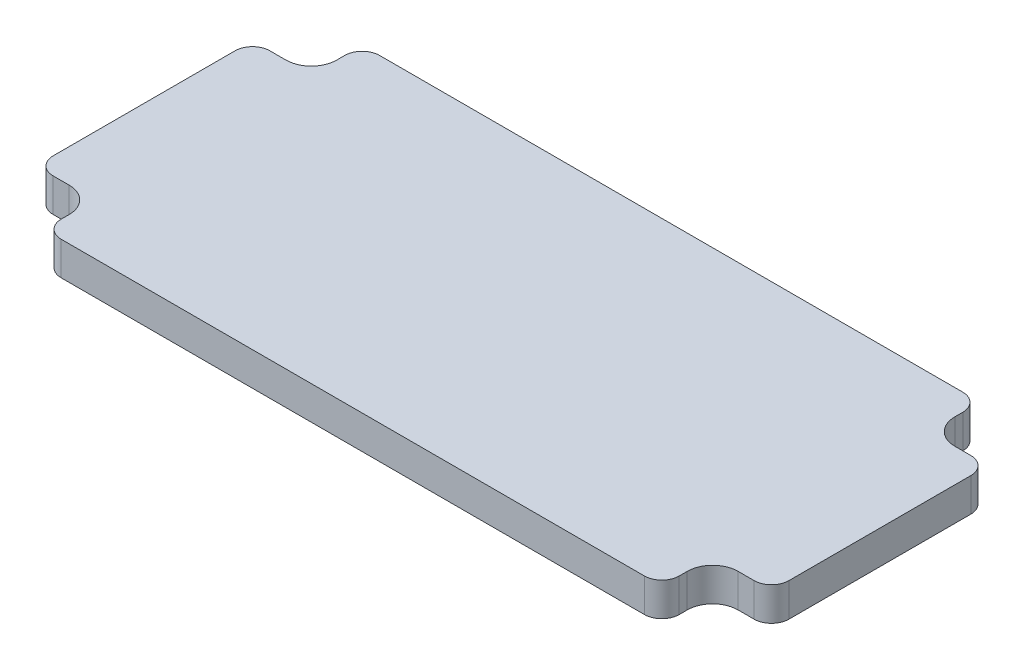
ISO-10303-21;
HEADER;
FILE_DESCRIPTION(('STEP AP214'),'2;1');
FILE_NAME('part.step','',(''),(''),'','','');
FILE_SCHEMA(('AUTOMOTIVE_DESIGN { 1 0 10303 214 1 1 1 1 }'));
ENDSEC;
DATA;
#1=APPLICATION_CONTEXT('core data for automotive mechanical design processes');
#2=APPLICATION_PROTOCOL_DEFINITION('international standard','automotive_design',2000,#1);
#3=PRODUCT_CONTEXT('',#1,'mechanical');
#4=PRODUCT('Part','Part','',(#3));
#5=PRODUCT_RELATED_PRODUCT_CATEGORY('part','',(#4));
#6=PRODUCT_DEFINITION_FORMATION('','',#4);
#7=PRODUCT_DEFINITION_CONTEXT('part definition',#1,'design');
#8=PRODUCT_DEFINITION('design','',#6,#7);
#9=PRODUCT_DEFINITION_SHAPE('','',#8);
#10=(LENGTH_UNIT() NAMED_UNIT(*) SI_UNIT(.MILLI.,.METRE.));
#11=(NAMED_UNIT(*) PLANE_ANGLE_UNIT() SI_UNIT($,.RADIAN.));
#12=(NAMED_UNIT(*) SI_UNIT($,.STERADIAN.) SOLID_ANGLE_UNIT());
#13=UNCERTAINTY_MEASURE_WITH_UNIT(LENGTH_MEASURE(1.E-05),#10,'distance_accuracy_value','');
#14=(GEOMETRIC_REPRESENTATION_CONTEXT(3) GLOBAL_UNCERTAINTY_ASSIGNED_CONTEXT((#13)) GLOBAL_UNIT_ASSIGNED_CONTEXT((#10,
#11,#12)) REPRESENTATION_CONTEXT('',''));
#15=CARTESIAN_POINT('',(0.,0.,0.));
#16=DIRECTION('',(0.,0.,1.));
#17=DIRECTION('',(1.,0.,0.));
#18=AXIS2_PLACEMENT_3D('',#15,#16,#17);
#19=CARTESIAN_POINT('',(0.,6.35,-30.226));
#20=DIRECTION('',(0.,0.,1.));
#21=DIRECTION('',(1.,0.,0.));
#22=AXIS2_PLACEMENT_3D('',#19,#20,#21);
#23=PLANE('',#22);
#24=DIRECTION('',(-1.,0.,0.));
#25=VECTOR('',#24,1.);
#26=CARTESIAN_POINT('',(0.,0.,-30.226));
#27=LINE('',#26,#25);
#28=CARTESIAN_POINT('',(55.372,0.,-30.226));
#29=VERTEX_POINT('',#28);
#30=CARTESIAN_POINT('',(-55.372,0.,-30.226));
#31=VERTEX_POINT('',#30);
#32=EDGE_CURVE('E127',#29,#31,#27,.T.);
#33=ORIENTED_EDGE('',*,*,#32,.T.);
#34=DIRECTION('',(0.,-1.,0.));
#35=VECTOR('',#34,1.);
#36=CARTESIAN_POINT('',(-55.372,6.35,-30.226));
#37=LINE('',#36,#35);
#38=CARTESIAN_POINT('',(-55.372,6.35,-30.226));
#39=VERTEX_POINT('',#38);
#40=EDGE_CURVE('E11',#39,#31,#37,.T.);
#41=ORIENTED_EDGE('',*,*,#40,.F.);
#42=DIRECTION('',(-1.,0.,0.));
#43=VECTOR('',#42,1.);
#44=CARTESIAN_POINT('',(0.,6.35,-30.226));
#45=LINE('',#44,#43);
#46=CARTESIAN_POINT('',(55.372,6.35,-30.226));
#47=VERTEX_POINT('',#46);
#48=EDGE_CURVE('E89',#47,#39,#45,.T.);
#49=ORIENTED_EDGE('',*,*,#48,.F.);
#50=DIRECTION('',(0.,-1.,0.));
#51=VECTOR('',#50,1.);
#52=CARTESIAN_POINT('',(55.372,6.35,-30.226));
#53=LINE('',#52,#51);
#54=EDGE_CURVE('E189',#47,#29,#53,.T.);
#55=ORIENTED_EDGE('',*,*,#54,.T.);
#56=EDGE_LOOP('',(#33,#41,#49,#55));
#57=FACE_BOUND('',#56,.T.);
#58=ADVANCED_FACE('F35',(#57),#23,.F.);
#59=CARTESIAN_POINT('',(-55.372,6.35,-26.924));
#60=DIRECTION('',(0.,-1.,0.));
#61=DIRECTION('',(0.,0.,-1.));
#62=AXIS2_PLACEMENT_3D('',#59,#60,#61);
#63=CYLINDRICAL_SURFACE('',#62,3.302);
#64=CARTESIAN_POINT('',(-55.372,0.,-26.924));
#65=DIRECTION('',(0.,1.,0.));
#66=DIRECTION('',(0.,0.,1.));
#67=AXIS2_PLACEMENT_3D('',#64,#65,#66);
#68=CIRCLE('',#67,3.302);
#69=CARTESIAN_POINT('',(-58.674,0.,-26.924));
#70=VERTEX_POINT('',#69);
#71=EDGE_CURVE('E129',#31,#70,#68,.T.);
#72=ORIENTED_EDGE('',*,*,#71,.T.);
#73=DIRECTION('',(0.,-1.,0.));
#74=VECTOR('',#73,1.);
#75=CARTESIAN_POINT('',(-58.674,6.35,-26.924));
#76=LINE('',#75,#74);
#77=CARTESIAN_POINT('',(-58.674,6.35,-26.924));
#78=VERTEX_POINT('',#77);
#79=EDGE_CURVE('E43',#78,#70,#76,.T.);
#80=ORIENTED_EDGE('',*,*,#79,.F.);
#81=CARTESIAN_POINT('',(-55.372,6.35,-26.924));
#82=DIRECTION('',(0.,1.,0.));
#83=DIRECTION('',(0.,0.,1.));
#84=AXIS2_PLACEMENT_3D('',#81,#82,#83);
#85=CIRCLE('',#84,3.302);
#86=EDGE_CURVE('E183',#39,#78,#85,.T.);
#87=ORIENTED_EDGE('',*,*,#86,.F.);
#88=ORIENTED_EDGE('',*,*,#40,.T.);
#89=EDGE_LOOP('',(#72,#80,#87,#88));
#90=FACE_BOUND('',#89,.T.);
#91=ADVANCED_FACE('F184',(#90),#63,.T.);
#92=CARTESIAN_POINT('',(-58.674,6.35,-25.4));
#93=DIRECTION('',(1.,0.,0.));
#94=DIRECTION('',(0.,0.,-1.));
#95=AXIS2_PLACEMENT_3D('',#92,#93,#94);
#96=PLANE('',#95);
#97=DIRECTION('',(0.,0.,1.));
#98=VECTOR('',#97,1.);
#99=CARTESIAN_POINT('',(-58.674,0.,-25.4));
#100=LINE('',#99,#98);
#101=CARTESIAN_POINT('',(-58.674,0.,-25.4));
#102=VERTEX_POINT('',#101);
#103=EDGE_CURVE('E132',#70,#102,#100,.T.);
#104=ORIENTED_EDGE('',*,*,#103,.T.);
#105=DIRECTION('',(0.,-1.,0.));
#106=VECTOR('',#105,1.);
#107=CARTESIAN_POINT('',(-58.674,6.35,-25.4));
#108=LINE('',#107,#106);
#109=CARTESIAN_POINT('',(-58.674,6.35,-25.4));
#110=VERTEX_POINT('',#109);
#111=EDGE_CURVE('E116',#110,#102,#108,.T.);
#112=ORIENTED_EDGE('',*,*,#111,.F.);
#113=DIRECTION('',(0.,0.,1.));
#114=VECTOR('',#113,1.);
#115=CARTESIAN_POINT('',(-58.674,6.35,-25.4));
#116=LINE('',#115,#114);
#117=EDGE_CURVE('E107',#78,#110,#116,.T.);
#118=ORIENTED_EDGE('',*,*,#117,.F.);
#119=ORIENTED_EDGE('',*,*,#79,.T.);
#120=EDGE_LOOP('',(#104,#112,#118,#119));
#121=FACE_BOUND('',#120,.T.);
#122=ADVANCED_FACE('F146',(#121),#96,.F.);
#123=CARTESIAN_POINT('',(-63.5,6.35,-25.4));
#124=DIRECTION('',(0.,-1.,0.));
#125=DIRECTION('',(0.,0.,-1.));
#126=AXIS2_PLACEMENT_3D('',#123,#124,#125);
#127=CYLINDRICAL_SURFACE('',#126,4.826);
#128=CARTESIAN_POINT('',(-63.5,0.,-25.4));
#129=DIRECTION('',(0.,-1.,0.));
#130=DIRECTION('',(0.,0.,1.));
#131=AXIS2_PLACEMENT_3D('',#128,#129,#130);
#132=CIRCLE('',#131,4.826);
#133=CARTESIAN_POINT('',(-63.5,0.,-20.574));
#134=VERTEX_POINT('',#133);
#135=EDGE_CURVE('E115',#102,#134,#132,.T.);
#136=ORIENTED_EDGE('',*,*,#135,.T.);
#137=DIRECTION('',(0.,-1.,0.));
#138=VECTOR('',#137,1.);
#139=CARTESIAN_POINT('',(-63.5,6.35,-20.574));
#140=LINE('',#139,#138);
#141=CARTESIAN_POINT('',(-63.5,6.35,-20.574));
#142=VERTEX_POINT('',#141);
#143=EDGE_CURVE('E112',#142,#134,#140,.T.);
#144=ORIENTED_EDGE('',*,*,#143,.F.);
#145=CARTESIAN_POINT('',(-63.5,6.35,-25.4));
#146=DIRECTION('',(0.,-1.,0.));
#147=DIRECTION('',(0.,0.,1.));
#148=AXIS2_PLACEMENT_3D('',#145,#146,#147);
#149=CIRCLE('',#148,4.826);
#150=EDGE_CURVE('E100',#110,#142,#149,.T.);
#151=ORIENTED_EDGE('',*,*,#150,.F.);
#152=ORIENTED_EDGE('',*,*,#111,.T.);
#153=EDGE_LOOP('',(#136,#144,#151,#152));
#154=FACE_BOUND('',#153,.T.);
#155=ADVANCED_FACE('F113',(#154),#127,.F.);
#156=CARTESIAN_POINT('',(-63.5,6.35,-20.574));
#157=DIRECTION('',(0.,0.,1.));
#158=DIRECTION('',(1.,0.,0.));
#159=AXIS2_PLACEMENT_3D('',#156,#157,#158);
#160=PLANE('',#159);
#161=DIRECTION('',(-1.,0.,0.));
#162=VECTOR('',#161,1.);
#163=CARTESIAN_POINT('',(-63.5,0.,-20.574));
#164=LINE('',#163,#162);
#165=CARTESIAN_POINT('',(-66.548,0.,-20.574));
#166=VERTEX_POINT('',#165);
#167=EDGE_CURVE('E75',#134,#166,#164,.T.);
#168=ORIENTED_EDGE('',*,*,#167,.T.);
#169=DIRECTION('',(0.,-1.,0.));
#170=VECTOR('',#169,1.);
#171=CARTESIAN_POINT('',(-66.548,6.35,-20.574));
#172=LINE('',#171,#170);
#173=CARTESIAN_POINT('',(-66.548,6.35,-20.574));
#174=VERTEX_POINT('',#173);
#175=EDGE_CURVE('E117',#174,#166,#172,.T.);
#176=ORIENTED_EDGE('',*,*,#175,.F.);
#177=DIRECTION('',(-1.,0.,0.));
#178=VECTOR('',#177,1.);
#179=CARTESIAN_POINT('',(-63.5,6.35,-20.574));
#180=LINE('',#179,#178);
#181=EDGE_CURVE('E105',#142,#174,#180,.T.);
#182=ORIENTED_EDGE('',*,*,#181,.F.);
#183=ORIENTED_EDGE('',*,*,#143,.T.);
#184=EDGE_LOOP('',(#168,#176,#182,#183));
#185=FACE_BOUND('',#184,.T.);
#186=ADVANCED_FACE('F119',(#185),#160,.F.);
#187=CARTESIAN_POINT('',(-66.548,6.35,-17.272));
#188=DIRECTION('',(0.,-1.,0.));
#189=DIRECTION('',(0.,0.,-1.));
#190=AXIS2_PLACEMENT_3D('',#187,#188,#189);
#191=CYLINDRICAL_SURFACE('',#190,3.302);
#192=CARTESIAN_POINT('',(-66.548,0.,-17.272));
#193=DIRECTION('',(0.,1.,0.));
#194=DIRECTION('',(0.,0.,-1.));
#195=AXIS2_PLACEMENT_3D('',#192,#193,#194);
#196=CIRCLE('',#195,3.302);
#197=CARTESIAN_POINT('',(-69.85,0.,-17.272));
#198=VERTEX_POINT('',#197);
#199=EDGE_CURVE('E81',#166,#198,#196,.T.);
#200=ORIENTED_EDGE('',*,*,#199,.T.);
#201=DIRECTION('',(0.,-1.,0.));
#202=VECTOR('',#201,1.);
#203=CARTESIAN_POINT('',(-69.85,6.35,-17.272));
#204=LINE('',#203,#202);
#205=CARTESIAN_POINT('',(-69.85,6.35,-17.272));
#206=VERTEX_POINT('',#205);
#207=EDGE_CURVE('E126',#206,#198,#204,.T.);
#208=ORIENTED_EDGE('',*,*,#207,.F.);
#209=CARTESIAN_POINT('',(-66.548,6.35,-17.272));
#210=DIRECTION('',(0.,1.,0.));
#211=DIRECTION('',(0.,0.,-1.));
#212=AXIS2_PLACEMENT_3D('',#209,#210,#211);
#213=CIRCLE('',#212,3.302);
#214=EDGE_CURVE('E51',#174,#206,#213,.T.);
#215=ORIENTED_EDGE('',*,*,#214,.F.);
#216=ORIENTED_EDGE('',*,*,#175,.T.);
#217=EDGE_LOOP('',(#200,#208,#215,#216));
#218=FACE_BOUND('',#217,.T.);
#219=ADVANCED_FACE('F484',(#218),#191,.T.);
#220=CARTESIAN_POINT('',(-69.85,6.35,0.));
#221=DIRECTION('',(1.,0.,0.));
#222=DIRECTION('',(0.,0.,-1.));
#223=AXIS2_PLACEMENT_3D('',#220,#221,#222);
#224=PLANE('',#223);
#225=DIRECTION('',(0.,0.,1.));
#226=VECTOR('',#225,1.);
#227=CARTESIAN_POINT('',(-69.85,0.,0.));
#228=LINE('',#227,#226);
#229=CARTESIAN_POINT('',(-69.85,0.,17.272));
#230=VERTEX_POINT('',#229);
#231=EDGE_CURVE('E137',#198,#230,#228,.T.);
#232=ORIENTED_EDGE('',*,*,#231,.T.);
#233=DIRECTION('',(0.,-1.,0.));
#234=VECTOR('',#233,1.);
#235=CARTESIAN_POINT('',(-69.85,6.35,17.272));
#236=LINE('',#235,#234);
#237=CARTESIAN_POINT('',(-69.85,6.35,17.272));
#238=VERTEX_POINT('',#237);
#239=EDGE_CURVE('E130',#238,#230,#236,.T.);
#240=ORIENTED_EDGE('',*,*,#239,.F.);
#241=DIRECTION('',(0.,0.,1.));
#242=VECTOR('',#241,1.);
#243=CARTESIAN_POINT('',(-69.85,6.35,0.));
#244=LINE('',#243,#242);
#245=EDGE_CURVE('E121',#206,#238,#244,.T.);
#246=ORIENTED_EDGE('',*,*,#245,.F.);
#247=ORIENTED_EDGE('',*,*,#207,.T.);
#248=EDGE_LOOP('',(#232,#240,#246,#247));
#249=FACE_BOUND('',#248,.T.);
#250=ADVANCED_FACE('F163',(#249),#224,.F.);
#251=CARTESIAN_POINT('',(-55.372,6.35,-26.924));
#252=DIRECTION('',(0.,1.,0.));
#253=DIRECTION('',(0.,0.,1.));
#254=AXIS2_PLACEMENT_3D('',#251,#252,#253);
#255=PLANE('',#254);
#256=DIRECTION('',(-1.,0.,0.));
#257=VECTOR('',#256,1.);
#258=CARTESIAN_POINT('',(0.,6.35,30.226));
#259=LINE('',#258,#257);
#260=CARTESIAN_POINT('',(55.372,6.35,30.226));
#261=VERTEX_POINT('',#260);
#262=CARTESIAN_POINT('',(-55.372,6.35,30.226));
#263=VERTEX_POINT('',#262);
#264=EDGE_CURVE('E243',#261,#263,#259,.T.);
#265=ORIENTED_EDGE('',*,*,#264,.F.);
#266=CARTESIAN_POINT('',(55.372,6.35,26.924));
#267=DIRECTION('',(0.,1.,0.));
#268=DIRECTION('',(0.,0.,-1.));
#269=AXIS2_PLACEMENT_3D('',#266,#267,#268);
#270=CIRCLE('',#269,3.302);
#271=CARTESIAN_POINT('',(58.674,6.35,26.924));
#272=VERTEX_POINT('',#271);
#273=EDGE_CURVE('E357',#261,#272,#270,.T.);
#274=ORIENTED_EDGE('',*,*,#273,.T.);
#275=DIRECTION('',(0.,0.,-1.));
#276=VECTOR('',#275,1.);
#277=CARTESIAN_POINT('',(58.674,6.35,25.4));
#278=LINE('',#277,#276);
#279=CARTESIAN_POINT('',(58.674,6.35,25.4));
#280=VERTEX_POINT('',#279);
#281=EDGE_CURVE('E376',#272,#280,#278,.T.);
#282=ORIENTED_EDGE('',*,*,#281,.T.);
#283=CARTESIAN_POINT('',(63.5,6.35,25.4));
#284=DIRECTION('',(0.,-1.,0.));
#285=DIRECTION('',(0.,0.,-1.));
#286=AXIS2_PLACEMENT_3D('',#283,#284,#285);
#287=CIRCLE('',#286,4.826);
#288=CARTESIAN_POINT('',(63.5,6.35,20.574));
#289=VERTEX_POINT('',#288);
#290=EDGE_CURVE('E373',#280,#289,#287,.T.);
#291=ORIENTED_EDGE('',*,*,#290,.T.);
#292=DIRECTION('',(1.,0.,0.));
#293=VECTOR('',#292,1.);
#294=CARTESIAN_POINT('',(63.5,6.35,20.574));
#295=LINE('',#294,#293);
#296=CARTESIAN_POINT('',(66.548,6.35,20.574));
#297=VERTEX_POINT('',#296);
#298=EDGE_CURVE('E370',#289,#297,#295,.T.);
#299=ORIENTED_EDGE('',*,*,#298,.T.);
#300=CARTESIAN_POINT('',(66.548,6.35,17.272));
#301=DIRECTION('',(0.,1.,0.));
#302=DIRECTION('',(0.,0.,1.));
#303=AXIS2_PLACEMENT_3D('',#300,#301,#302);
#304=CIRCLE('',#303,3.302);
#305=CARTESIAN_POINT('',(69.85,6.35,17.272));
#306=VERTEX_POINT('',#305);
#307=EDGE_CURVE('E353',#297,#306,#304,.T.);
#308=ORIENTED_EDGE('',*,*,#307,.T.);
#309=DIRECTION('',(0.,0.,1.));
#310=VECTOR('',#309,1.);
#311=CARTESIAN_POINT('',(69.85,6.35,0.));
#312=LINE('',#311,#310);
#313=CARTESIAN_POINT('',(69.85,6.35,-17.272));
#314=VERTEX_POINT('',#313);
#315=EDGE_CURVE('E305',#314,#306,#312,.T.);
#316=ORIENTED_EDGE('',*,*,#315,.F.);
#317=CARTESIAN_POINT('',(66.548,6.35,-17.272));
#318=DIRECTION('',(0.,-1.,0.));
#319=DIRECTION('',(0.,0.,-1.));
#320=AXIS2_PLACEMENT_3D('',#317,#318,#319);
#321=CIRCLE('',#320,3.302);
#322=CARTESIAN_POINT('',(66.548,6.35,-20.574));
#323=VERTEX_POINT('',#322);
#324=EDGE_CURVE('E332',#323,#314,#321,.T.);
#325=ORIENTED_EDGE('',*,*,#324,.F.);
#326=DIRECTION('',(1.,0.,0.));
#327=VECTOR('',#326,1.);
#328=CARTESIAN_POINT('',(63.5,6.35,-20.574));
#329=LINE('',#328,#327);
#330=CARTESIAN_POINT('',(63.5,6.35,-20.574));
#331=VERTEX_POINT('',#330);
#332=EDGE_CURVE('E329',#331,#323,#329,.T.);
#333=ORIENTED_EDGE('',*,*,#332,.F.);
#334=CARTESIAN_POINT('',(63.5,6.35,-25.4));
#335=DIRECTION('',(0.,1.,0.));
#336=DIRECTION('',(0.,0.,1.));
#337=AXIS2_PLACEMENT_3D('',#334,#335,#336);
#338=CIRCLE('',#337,4.826);
#339=CARTESIAN_POINT('',(58.674,6.35,-25.4));
#340=VERTEX_POINT('',#339);
#341=EDGE_CURVE('E326',#340,#331,#338,.T.);
#342=ORIENTED_EDGE('',*,*,#341,.F.);
#343=DIRECTION('',(0.,0.,1.));
#344=VECTOR('',#343,1.);
#345=CARTESIAN_POINT('',(58.674,6.35,-25.4));
#346=LINE('',#345,#344);
#347=CARTESIAN_POINT('',(58.674,6.35,-26.924));
#348=VERTEX_POINT('',#347);
#349=EDGE_CURVE('E323',#348,#340,#346,.T.);
#350=ORIENTED_EDGE('',*,*,#349,.F.);
#351=CARTESIAN_POINT('',(55.372,6.35,-26.924));
#352=DIRECTION('',(0.,-1.,0.));
#353=DIRECTION('',(0.,0.,1.));
#354=AXIS2_PLACEMENT_3D('',#351,#352,#353);
#355=CIRCLE('',#354,3.302);
#356=EDGE_CURVE('E303',#47,#348,#355,.T.);
#357=ORIENTED_EDGE('',*,*,#356,.F.);
#358=ORIENTED_EDGE('',*,*,#48,.T.);
#359=ORIENTED_EDGE('',*,*,#86,.T.);
#360=ORIENTED_EDGE('',*,*,#117,.T.);
#361=ORIENTED_EDGE('',*,*,#150,.T.);
#362=ORIENTED_EDGE('',*,*,#181,.T.);
#363=ORIENTED_EDGE('',*,*,#214,.T.);
#364=ORIENTED_EDGE('',*,*,#245,.T.);
#365=CARTESIAN_POINT('',(-66.548,6.35,17.272));
#366=DIRECTION('',(0.,-1.,0.));
#367=DIRECTION('',(0.,0.,1.));
#368=AXIS2_PLACEMENT_3D('',#365,#366,#367);
#369=CIRCLE('',#368,3.302);
#370=CARTESIAN_POINT('',(-66.548,6.35,20.574));
#371=VERTEX_POINT('',#370);
#372=EDGE_CURVE('E174',#371,#238,#369,.T.);
#373=ORIENTED_EDGE('',*,*,#372,.F.);
#374=DIRECTION('',(-1.,0.,0.));
#375=VECTOR('',#374,1.);
#376=CARTESIAN_POINT('',(-63.5,6.35,20.574));
#377=LINE('',#376,#375);
#378=CARTESIAN_POINT('',(-63.5,6.35,20.574));
#379=VERTEX_POINT('',#378);
#380=EDGE_CURVE('E256',#379,#371,#377,.T.);
#381=ORIENTED_EDGE('',*,*,#380,.F.);
#382=CARTESIAN_POINT('',(-63.5,6.35,25.4));
#383=DIRECTION('',(0.,1.,0.));
#384=DIRECTION('',(0.,0.,-1.));
#385=AXIS2_PLACEMENT_3D('',#382,#383,#384);
#386=CIRCLE('',#385,4.826);
#387=CARTESIAN_POINT('',(-58.674,6.35,25.4));
#388=VERTEX_POINT('',#387);
#389=EDGE_CURVE('E270',#388,#379,#386,.T.);
#390=ORIENTED_EDGE('',*,*,#389,.F.);
#391=DIRECTION('',(0.,0.,-1.));
#392=VECTOR('',#391,1.);
#393=CARTESIAN_POINT('',(-58.674,6.35,25.4));
#394=LINE('',#393,#392);
#395=CARTESIAN_POINT('',(-58.674,6.35,26.924));
#396=VERTEX_POINT('',#395);
#397=EDGE_CURVE('E284',#396,#388,#394,.T.);
#398=ORIENTED_EDGE('',*,*,#397,.F.);
#399=CARTESIAN_POINT('',(-55.372,6.35,26.924));
#400=DIRECTION('',(0.,-1.,0.));
#401=DIRECTION('',(0.,0.,-1.));
#402=AXIS2_PLACEMENT_3D('',#399,#400,#401);
#403=CIRCLE('',#402,3.302);
#404=EDGE_CURVE('E282',#263,#396,#403,.T.);
#405=ORIENTED_EDGE('',*,*,#404,.F.);
#406=EDGE_LOOP('',(#265,#274,#282,#291,#299,#308,#316,#325,#333,#342,#350,#357,#358,#359,#360,
#361,#362,#363,#364,#373,#381,#390,#398,#405));
#407=FACE_BOUND('',#406,.T.);
#408=ADVANCED_FACE('F103',(#407),#255,.T.);
#409=CARTESIAN_POINT('',(-55.372,0.,-26.924));
#410=DIRECTION('',(0.,1.,0.));
#411=DIRECTION('',(0.,0.,1.));
#412=AXIS2_PLACEMENT_3D('',#409,#410,#411);
#413=PLANE('',#412);
#414=CARTESIAN_POINT('',(55.372,0.,26.924));
#415=DIRECTION('',(0.,1.,0.));
#416=DIRECTION('',(0.,0.,-1.));
#417=AXIS2_PLACEMENT_3D('',#414,#415,#416);
#418=CIRCLE('',#417,3.302);
#419=CARTESIAN_POINT('',(55.372,0.,30.226));
#420=VERTEX_POINT('',#419);
#421=CARTESIAN_POINT('',(58.674,0.,26.924));
#422=VERTEX_POINT('',#421);
#423=EDGE_CURVE('E254',#420,#422,#418,.T.);
#424=ORIENTED_EDGE('',*,*,#423,.F.);
#425=DIRECTION('',(-1.,0.,0.));
#426=VECTOR('',#425,1.);
#427=CARTESIAN_POINT('',(0.,0.,30.226));
#428=LINE('',#427,#426);
#429=CARTESIAN_POINT('',(-55.372,0.,30.226));
#430=VERTEX_POINT('',#429);
#431=EDGE_CURVE('E241',#420,#430,#428,.T.);
#432=ORIENTED_EDGE('',*,*,#431,.T.);
#433=CARTESIAN_POINT('',(-55.372,0.,26.924));
#434=DIRECTION('',(0.,-1.,0.));
#435=DIRECTION('',(0.,0.,-1.));
#436=AXIS2_PLACEMENT_3D('',#433,#434,#435);
#437=CIRCLE('',#436,3.302);
#438=CARTESIAN_POINT('',(-58.674,0.,26.924));
#439=VERTEX_POINT('',#438);
#440=EDGE_CURVE('E247',#430,#439,#437,.T.);
#441=ORIENTED_EDGE('',*,*,#440,.T.);
#442=DIRECTION('',(0.,0.,-1.));
#443=VECTOR('',#442,1.);
#444=CARTESIAN_POINT('',(-58.674,0.,25.4));
#445=LINE('',#444,#443);
#446=CARTESIAN_POINT('',(-58.674,0.,25.4));
#447=VERTEX_POINT('',#446);
#448=EDGE_CURVE('E250',#439,#447,#445,.T.);
#449=ORIENTED_EDGE('',*,*,#448,.T.);
#450=CARTESIAN_POINT('',(-63.5,0.,25.4));
#451=DIRECTION('',(0.,1.,0.));
#452=DIRECTION('',(0.,0.,-1.));
#453=AXIS2_PLACEMENT_3D('',#450,#451,#452);
#454=CIRCLE('',#453,4.826);
#455=CARTESIAN_POINT('',(-63.5,0.,20.574));
#456=VERTEX_POINT('',#455);
#457=EDGE_CURVE('E268',#447,#456,#454,.T.);
#458=ORIENTED_EDGE('',*,*,#457,.T.);
#459=DIRECTION('',(-1.,0.,0.));
#460=VECTOR('',#459,1.);
#461=CARTESIAN_POINT('',(-63.5,0.,20.574));
#462=LINE('',#461,#460);
#463=CARTESIAN_POINT('',(-66.548,0.,20.574));
#464=VERTEX_POINT('',#463);
#465=EDGE_CURVE('E274',#456,#464,#462,.T.);
#466=ORIENTED_EDGE('',*,*,#465,.T.);
#467=CARTESIAN_POINT('',(-66.548,0.,17.272));
#468=DIRECTION('',(0.,-1.,0.));
#469=DIRECTION('',(0.,0.,1.));
#470=AXIS2_PLACEMENT_3D('',#467,#468,#469);
#471=CIRCLE('',#470,3.302);
#472=EDGE_CURVE('E159',#464,#230,#471,.T.);
#473=ORIENTED_EDGE('',*,*,#472,.T.);
#474=ORIENTED_EDGE('',*,*,#231,.F.);
#475=ORIENTED_EDGE('',*,*,#199,.F.);
#476=ORIENTED_EDGE('',*,*,#167,.F.);
#477=ORIENTED_EDGE('',*,*,#135,.F.);
#478=ORIENTED_EDGE('',*,*,#103,.F.);
#479=ORIENTED_EDGE('',*,*,#71,.F.);
#480=ORIENTED_EDGE('',*,*,#32,.F.);
#481=CARTESIAN_POINT('',(55.372,0.,-26.924));
#482=DIRECTION('',(0.,-1.,0.));
#483=DIRECTION('',(0.,0.,1.));
#484=AXIS2_PLACEMENT_3D('',#481,#482,#483);
#485=CIRCLE('',#484,3.302);
#486=CARTESIAN_POINT('',(58.674,0.,-26.924));
#487=VERTEX_POINT('',#486);
#488=EDGE_CURVE('E194',#29,#487,#485,.T.);
#489=ORIENTED_EDGE('',*,*,#488,.T.);
#490=DIRECTION('',(0.,0.,1.));
#491=VECTOR('',#490,1.);
#492=CARTESIAN_POINT('',(58.674,0.,-25.4));
#493=LINE('',#492,#491);
#494=CARTESIAN_POINT('',(58.674,0.,-25.4));
#495=VERTEX_POINT('',#494);
#496=EDGE_CURVE('E306',#487,#495,#493,.T.);
#497=ORIENTED_EDGE('',*,*,#496,.T.);
#498=CARTESIAN_POINT('',(63.5,0.,-25.4));
#499=DIRECTION('',(0.,1.,0.));
#500=DIRECTION('',(0.,0.,1.));
#501=AXIS2_PLACEMENT_3D('',#498,#499,#500);
#502=CIRCLE('',#501,4.826);
#503=CARTESIAN_POINT('',(63.5,0.,-20.574));
#504=VERTEX_POINT('',#503);
#505=EDGE_CURVE('E308',#495,#504,#502,.T.);
#506=ORIENTED_EDGE('',*,*,#505,.T.);
#507=DIRECTION('',(1.,0.,0.));
#508=VECTOR('',#507,1.);
#509=CARTESIAN_POINT('',(63.5,0.,-20.574));
#510=LINE('',#509,#508);
#511=CARTESIAN_POINT('',(66.548,0.,-20.574));
#512=VERTEX_POINT('',#511);
#513=EDGE_CURVE('E311',#504,#512,#510,.T.);
#514=ORIENTED_EDGE('',*,*,#513,.T.);
#515=CARTESIAN_POINT('',(66.548,0.,-17.272));
#516=DIRECTION('',(0.,-1.,0.));
#517=DIRECTION('',(0.,0.,-1.));
#518=AXIS2_PLACEMENT_3D('',#515,#516,#517);
#519=CIRCLE('',#518,3.302);
#520=CARTESIAN_POINT('',(69.85,0.,-17.272));
#521=VERTEX_POINT('',#520);
#522=EDGE_CURVE('E314',#512,#521,#519,.T.);
#523=ORIENTED_EDGE('',*,*,#522,.T.);
#524=DIRECTION('',(0.,0.,1.));
#525=VECTOR('',#524,1.);
#526=CARTESIAN_POINT('',(69.85,0.,0.));
#527=LINE('',#526,#525);
#528=CARTESIAN_POINT('',(69.85,0.,17.272));
#529=VERTEX_POINT('',#528);
#530=EDGE_CURVE('E317',#521,#529,#527,.T.);
#531=ORIENTED_EDGE('',*,*,#530,.T.);
#532=CARTESIAN_POINT('',(66.548,0.,17.272));
#533=DIRECTION('',(0.,1.,0.));
#534=DIRECTION('',(0.,0.,1.));
#535=AXIS2_PLACEMENT_3D('',#532,#533,#534);
#536=CIRCLE('',#535,3.302);
#537=CARTESIAN_POINT('',(66.548,0.,20.574));
#538=VERTEX_POINT('',#537);
#539=EDGE_CURVE('E354',#538,#529,#536,.T.);
#540=ORIENTED_EDGE('',*,*,#539,.F.);
#541=DIRECTION('',(1.,0.,0.));
#542=VECTOR('',#541,1.);
#543=CARTESIAN_POINT('',(63.5,0.,20.574));
#544=LINE('',#543,#542);
#545=CARTESIAN_POINT('',(63.5,0.,20.574));
#546=VERTEX_POINT('',#545);
#547=EDGE_CURVE('E358',#546,#538,#544,.T.);
#548=ORIENTED_EDGE('',*,*,#547,.F.);
#549=CARTESIAN_POINT('',(63.5,0.,25.4));
#550=DIRECTION('',(0.,-1.,0.));
#551=DIRECTION('',(0.,0.,-1.));
#552=AXIS2_PLACEMENT_3D('',#549,#550,#551);
#553=CIRCLE('',#552,4.826);
#554=CARTESIAN_POINT('',(58.674,0.,25.4));
#555=VERTEX_POINT('',#554);
#556=EDGE_CURVE('E361',#555,#546,#553,.T.);
#557=ORIENTED_EDGE('',*,*,#556,.F.);
#558=DIRECTION('',(0.,0.,-1.));
#559=VECTOR('',#558,1.);
#560=CARTESIAN_POINT('',(58.674,0.,25.4));
#561=LINE('',#560,#559);
#562=EDGE_CURVE('E364',#422,#555,#561,.T.);
#563=ORIENTED_EDGE('',*,*,#562,.F.);
#564=EDGE_LOOP('',(#424,#432,#441,#449,#458,#466,#473,#474,#475,#476,#477,#478,#479,#480,#489,
#497,#506,#514,#523,#531,#540,#548,#557,#563));
#565=FACE_BOUND('',#564,.T.);
#566=ADVANCED_FACE('F152',(#565),#413,.F.);
#567=CARTESIAN_POINT('',(-66.548,6.35,17.272));
#568=DIRECTION('',(0.,-1.,0.));
#569=DIRECTION('',(0.,0.,-1.));
#570=AXIS2_PLACEMENT_3D('',#567,#568,#569);
#571=CYLINDRICAL_SURFACE('',#570,3.302);
#572=ORIENTED_EDGE('',*,*,#472,.F.);
#573=DIRECTION('',(0.,-1.,0.));
#574=VECTOR('',#573,1.);
#575=CARTESIAN_POINT('',(-66.548,6.35,20.574));
#576=LINE('',#575,#574);
#577=EDGE_CURVE('E175',#371,#464,#576,.T.);
#578=ORIENTED_EDGE('',*,*,#577,.F.);
#579=ORIENTED_EDGE('',*,*,#372,.T.);
#580=ORIENTED_EDGE('',*,*,#239,.T.);
#581=EDGE_LOOP('',(#572,#578,#579,#580));
#582=FACE_BOUND('',#581,.T.);
#583=ADVANCED_FACE('F171',(#582),#571,.T.);
#584=CARTESIAN_POINT('',(-63.5,6.35,20.574));
#585=DIRECTION('',(0.,0.,1.));
#586=DIRECTION('',(1.,0.,0.));
#587=AXIS2_PLACEMENT_3D('',#584,#585,#586);
#588=PLANE('',#587);
#589=ORIENTED_EDGE('',*,*,#465,.F.);
#590=DIRECTION('',(0.,-1.,0.));
#591=VECTOR('',#590,1.);
#592=CARTESIAN_POINT('',(-63.5,6.35,20.574));
#593=LINE('',#592,#591);
#594=EDGE_CURVE('E178',#379,#456,#593,.T.);
#595=ORIENTED_EDGE('',*,*,#594,.F.);
#596=ORIENTED_EDGE('',*,*,#380,.T.);
#597=ORIENTED_EDGE('',*,*,#577,.T.);
#598=EDGE_LOOP('',(#589,#595,#596,#597));
#599=FACE_BOUND('',#598,.T.);
#600=ADVANCED_FACE('F275',(#599),#588,.T.);
#601=CARTESIAN_POINT('',(-63.5,6.35,25.4));
#602=DIRECTION('',(0.,-1.,0.));
#603=DIRECTION('',(0.,0.,-1.));
#604=AXIS2_PLACEMENT_3D('',#601,#602,#603);
#605=CYLINDRICAL_SURFACE('',#604,4.826);
#606=ORIENTED_EDGE('',*,*,#457,.F.);
#607=DIRECTION('',(0.,-1.,0.));
#608=VECTOR('',#607,1.);
#609=CARTESIAN_POINT('',(-58.674,6.35,25.4));
#610=LINE('',#609,#608);
#611=EDGE_CURVE('E261',#388,#447,#610,.T.);
#612=ORIENTED_EDGE('',*,*,#611,.F.);
#613=ORIENTED_EDGE('',*,*,#389,.T.);
#614=ORIENTED_EDGE('',*,*,#594,.T.);
#615=EDGE_LOOP('',(#606,#612,#613,#614));
#616=FACE_BOUND('',#615,.T.);
#617=ADVANCED_FACE('F266',(#616),#605,.F.);
#618=CARTESIAN_POINT('',(-58.674,6.35,25.4));
#619=DIRECTION('',(-1.,0.,0.));
#620=DIRECTION('',(0.,0.,1.));
#621=AXIS2_PLACEMENT_3D('',#618,#619,#620);
#622=PLANE('',#621);
#623=ORIENTED_EDGE('',*,*,#448,.F.);
#624=DIRECTION('',(0.,-1.,0.));
#625=VECTOR('',#624,1.);
#626=CARTESIAN_POINT('',(-58.674,6.35,26.924));
#627=LINE('',#626,#625);
#628=EDGE_CURVE('E230',#396,#439,#627,.T.);
#629=ORIENTED_EDGE('',*,*,#628,.F.);
#630=ORIENTED_EDGE('',*,*,#397,.T.);
#631=ORIENTED_EDGE('',*,*,#611,.T.);
#632=EDGE_LOOP('',(#623,#629,#630,#631));
#633=FACE_BOUND('',#632,.T.);
#634=ADVANCED_FACE('F499',(#633),#622,.T.);
#635=CARTESIAN_POINT('',(-55.372,6.35,26.924));
#636=DIRECTION('',(0.,-1.,0.));
#637=DIRECTION('',(0.,0.,-1.));
#638=AXIS2_PLACEMENT_3D('',#635,#636,#637);
#639=CYLINDRICAL_SURFACE('',#638,3.302);
#640=ORIENTED_EDGE('',*,*,#440,.F.);
#641=DIRECTION('',(0.,-1.,0.));
#642=VECTOR('',#641,1.);
#643=CARTESIAN_POINT('',(-55.372,6.35,30.226));
#644=LINE('',#643,#642);
#645=EDGE_CURVE('E236',#263,#430,#644,.T.);
#646=ORIENTED_EDGE('',*,*,#645,.F.);
#647=ORIENTED_EDGE('',*,*,#404,.T.);
#648=ORIENTED_EDGE('',*,*,#628,.T.);
#649=EDGE_LOOP('',(#640,#646,#647,#648));
#650=FACE_BOUND('',#649,.T.);
#651=ADVANCED_FACE('F248',(#650),#639,.T.);
#652=CARTESIAN_POINT('',(0.,6.35,30.226));
#653=DIRECTION('',(0.,0.,1.));
#654=DIRECTION('',(1.,0.,0.));
#655=AXIS2_PLACEMENT_3D('',#652,#653,#654);
#656=PLANE('',#655);
#657=ORIENTED_EDGE('',*,*,#431,.F.);
#658=DIRECTION('',(0.,-1.,0.));
#659=VECTOR('',#658,1.);
#660=CARTESIAN_POINT('',(55.372,6.35,30.226));
#661=LINE('',#660,#659);
#662=EDGE_CURVE('E320',#261,#420,#661,.T.);
#663=ORIENTED_EDGE('',*,*,#662,.F.);
#664=ORIENTED_EDGE('',*,*,#264,.T.);
#665=ORIENTED_EDGE('',*,*,#645,.T.);
#666=EDGE_LOOP('',(#657,#663,#664,#665));
#667=FACE_BOUND('',#666,.T.);
#668=ADVANCED_FACE('F237',(#667),#656,.T.);
#669=CARTESIAN_POINT('',(69.85,6.35,0.));
#670=DIRECTION('',(1.,0.,0.));
#671=DIRECTION('',(0.,0.,-1.));
#672=AXIS2_PLACEMENT_3D('',#669,#670,#671);
#673=PLANE('',#672);
#674=ORIENTED_EDGE('',*,*,#530,.F.);
#675=DIRECTION('',(0.,-1.,0.));
#676=VECTOR('',#675,1.);
#677=CARTESIAN_POINT('',(69.85,6.35,-17.272));
#678=LINE('',#677,#676);
#679=EDGE_CURVE('E280',#314,#521,#678,.T.);
#680=ORIENTED_EDGE('',*,*,#679,.F.);
#681=ORIENTED_EDGE('',*,*,#315,.T.);
#682=DIRECTION('',(0.,-1.,0.));
#683=VECTOR('',#682,1.);
#684=CARTESIAN_POINT('',(69.85,6.35,17.272));
#685=LINE('',#684,#683);
#686=EDGE_CURVE('E350',#306,#529,#685,.T.);
#687=ORIENTED_EDGE('',*,*,#686,.T.);
#688=EDGE_LOOP('',(#674,#680,#681,#687));
#689=FACE_BOUND('',#688,.T.);
#690=ADVANCED_FACE('F454',(#689),#673,.T.);
#691=CARTESIAN_POINT('',(66.548,6.35,-17.272));
#692=DIRECTION('',(0.,-1.,0.));
#693=DIRECTION('',(0.,0.,-1.));
#694=AXIS2_PLACEMENT_3D('',#691,#692,#693);
#695=CYLINDRICAL_SURFACE('',#694,3.302);
#696=ORIENTED_EDGE('',*,*,#522,.F.);
#697=DIRECTION('',(0.,-1.,0.));
#698=VECTOR('',#697,1.);
#699=CARTESIAN_POINT('',(66.548,6.35,-20.574));
#700=LINE('',#699,#698);
#701=EDGE_CURVE('E291',#323,#512,#700,.T.);
#702=ORIENTED_EDGE('',*,*,#701,.F.);
#703=ORIENTED_EDGE('',*,*,#324,.T.);
#704=ORIENTED_EDGE('',*,*,#679,.T.);
#705=EDGE_LOOP('',(#696,#702,#703,#704));
#706=FACE_BOUND('',#705,.T.);
#707=ADVANCED_FACE('F450',(#706),#695,.T.);
#708=CARTESIAN_POINT('',(63.5,6.35,-20.574));
#709=DIRECTION('',(0.,0.,-1.));
#710=DIRECTION('',(-1.,0.,0.));
#711=AXIS2_PLACEMENT_3D('',#708,#709,#710);
#712=PLANE('',#711);
#713=ORIENTED_EDGE('',*,*,#513,.F.);
#714=DIRECTION('',(0.,-1.,0.));
#715=VECTOR('',#714,1.);
#716=CARTESIAN_POINT('',(63.5,6.35,-20.574));
#717=LINE('',#716,#715);
#718=EDGE_CURVE('E294',#331,#504,#717,.T.);
#719=ORIENTED_EDGE('',*,*,#718,.F.);
#720=ORIENTED_EDGE('',*,*,#332,.T.);
#721=ORIENTED_EDGE('',*,*,#701,.T.);
#722=EDGE_LOOP('',(#713,#719,#720,#721));
#723=FACE_BOUND('',#722,.T.);
#724=ADVANCED_FACE('F446',(#723),#712,.T.);
#725=CARTESIAN_POINT('',(63.5,6.35,-25.4));
#726=DIRECTION('',(0.,-1.,0.));
#727=DIRECTION('',(0.,0.,-1.));
#728=AXIS2_PLACEMENT_3D('',#725,#726,#727);
#729=CYLINDRICAL_SURFACE('',#728,4.826);
#730=ORIENTED_EDGE('',*,*,#505,.F.);
#731=DIRECTION('',(0.,-1.,0.));
#732=VECTOR('',#731,1.);
#733=CARTESIAN_POINT('',(58.674,6.35,-25.4));
#734=LINE('',#733,#732);
#735=EDGE_CURVE('E297',#340,#495,#734,.T.);
#736=ORIENTED_EDGE('',*,*,#735,.F.);
#737=ORIENTED_EDGE('',*,*,#341,.T.);
#738=ORIENTED_EDGE('',*,*,#718,.T.);
#739=EDGE_LOOP('',(#730,#736,#737,#738));
#740=FACE_BOUND('',#739,.T.);
#741=ADVANCED_FACE('F442',(#740),#729,.F.);
#742=CARTESIAN_POINT('',(58.674,6.35,-25.4));
#743=DIRECTION('',(1.,0.,0.));
#744=DIRECTION('',(0.,0.,-1.));
#745=AXIS2_PLACEMENT_3D('',#742,#743,#744);
#746=PLANE('',#745);
#747=ORIENTED_EDGE('',*,*,#496,.F.);
#748=DIRECTION('',(0.,-1.,0.));
#749=VECTOR('',#748,1.);
#750=CARTESIAN_POINT('',(58.674,6.35,-26.924));
#751=LINE('',#750,#749);
#752=EDGE_CURVE('E300',#348,#487,#751,.T.);
#753=ORIENTED_EDGE('',*,*,#752,.F.);
#754=ORIENTED_EDGE('',*,*,#349,.T.);
#755=ORIENTED_EDGE('',*,*,#735,.T.);
#756=EDGE_LOOP('',(#747,#753,#754,#755));
#757=FACE_BOUND('',#756,.T.);
#758=ADVANCED_FACE('F438',(#757),#746,.T.);
#759=CARTESIAN_POINT('',(55.372,6.35,-26.924));
#760=DIRECTION('',(0.,-1.,0.));
#761=DIRECTION('',(0.,0.,-1.));
#762=AXIS2_PLACEMENT_3D('',#759,#760,#761);
#763=CYLINDRICAL_SURFACE('',#762,3.302);
#764=ORIENTED_EDGE('',*,*,#488,.F.);
#765=ORIENTED_EDGE('',*,*,#54,.F.);
#766=ORIENTED_EDGE('',*,*,#356,.T.);
#767=ORIENTED_EDGE('',*,*,#752,.T.);
#768=EDGE_LOOP('',(#764,#765,#766,#767));
#769=FACE_BOUND('',#768,.T.);
#770=ADVANCED_FACE('F517',(#769),#763,.T.);
#771=CARTESIAN_POINT('',(55.372,6.35,26.924));
#772=DIRECTION('',(0.,-1.,0.));
#773=DIRECTION('',(0.,0.,-1.));
#774=AXIS2_PLACEMENT_3D('',#771,#772,#773);
#775=CYLINDRICAL_SURFACE('',#774,3.302);
#776=ORIENTED_EDGE('',*,*,#423,.T.);
#777=DIRECTION('',(0.,-1.,0.));
#778=VECTOR('',#777,1.);
#779=CARTESIAN_POINT('',(58.674,6.35,26.924));
#780=LINE('',#779,#778);
#781=EDGE_CURVE('E338',#272,#422,#780,.T.);
#782=ORIENTED_EDGE('',*,*,#781,.F.);
#783=ORIENTED_EDGE('',*,*,#273,.F.);
#784=ORIENTED_EDGE('',*,*,#662,.T.);
#785=EDGE_LOOP('',(#776,#782,#783,#784));
#786=FACE_BOUND('',#785,.T.);
#787=ADVANCED_FACE('F389',(#786),#775,.T.);
#788=CARTESIAN_POINT('',(58.674,6.35,25.4));
#789=DIRECTION('',(-1.,0.,0.));
#790=DIRECTION('',(0.,0.,1.));
#791=AXIS2_PLACEMENT_3D('',#788,#789,#790);
#792=PLANE('',#791);
#793=ORIENTED_EDGE('',*,*,#562,.T.);
#794=DIRECTION('',(0.,-1.,0.));
#795=VECTOR('',#794,1.);
#796=CARTESIAN_POINT('',(58.674,6.35,25.4));
#797=LINE('',#796,#795);
#798=EDGE_CURVE('E341',#280,#555,#797,.T.);
#799=ORIENTED_EDGE('',*,*,#798,.F.);
#800=ORIENTED_EDGE('',*,*,#281,.F.);
#801=ORIENTED_EDGE('',*,*,#781,.T.);
#802=EDGE_LOOP('',(#793,#799,#800,#801));
#803=FACE_BOUND('',#802,.T.);
#804=ADVANCED_FACE('F392',(#803),#792,.F.);
#805=CARTESIAN_POINT('',(63.5,6.35,25.4));
#806=DIRECTION('',(0.,-1.,0.));
#807=DIRECTION('',(0.,0.,-1.));
#808=AXIS2_PLACEMENT_3D('',#805,#806,#807);
#809=CYLINDRICAL_SURFACE('',#808,4.826);
#810=ORIENTED_EDGE('',*,*,#556,.T.);
#811=DIRECTION('',(0.,-1.,0.));
#812=VECTOR('',#811,1.);
#813=CARTESIAN_POINT('',(63.5,6.35,20.574));
#814=LINE('',#813,#812);
#815=EDGE_CURVE('E344',#289,#546,#814,.T.);
#816=ORIENTED_EDGE('',*,*,#815,.F.);
#817=ORIENTED_EDGE('',*,*,#290,.F.);
#818=ORIENTED_EDGE('',*,*,#798,.T.);
#819=EDGE_LOOP('',(#810,#816,#817,#818));
#820=FACE_BOUND('',#819,.T.);
#821=ADVANCED_FACE('F400',(#820),#809,.F.);
#822=CARTESIAN_POINT('',(63.5,6.35,20.574));
#823=DIRECTION('',(0.,0.,-1.));
#824=DIRECTION('',(-1.,0.,0.));
#825=AXIS2_PLACEMENT_3D('',#822,#823,#824);
#826=PLANE('',#825);
#827=ORIENTED_EDGE('',*,*,#547,.T.);
#828=DIRECTION('',(0.,-1.,0.));
#829=VECTOR('',#828,1.);
#830=CARTESIAN_POINT('',(66.548,6.35,20.574));
#831=LINE('',#830,#829);
#832=EDGE_CURVE('E347',#297,#538,#831,.T.);
#833=ORIENTED_EDGE('',*,*,#832,.F.);
#834=ORIENTED_EDGE('',*,*,#298,.F.);
#835=ORIENTED_EDGE('',*,*,#815,.T.);
#836=EDGE_LOOP('',(#827,#833,#834,#835));
#837=FACE_BOUND('',#836,.T.);
#838=ADVANCED_FACE('F462',(#837),#826,.F.);
#839=CARTESIAN_POINT('',(66.548,6.35,17.272));
#840=DIRECTION('',(0.,-1.,0.));
#841=DIRECTION('',(0.,0.,-1.));
#842=AXIS2_PLACEMENT_3D('',#839,#840,#841);
#843=CYLINDRICAL_SURFACE('',#842,3.302);
#844=ORIENTED_EDGE('',*,*,#539,.T.);
#845=ORIENTED_EDGE('',*,*,#686,.F.);
#846=ORIENTED_EDGE('',*,*,#307,.F.);
#847=ORIENTED_EDGE('',*,*,#832,.T.);
#848=EDGE_LOOP('',(#844,#845,#846,#847));
#849=FACE_BOUND('',#848,.T.);
#850=ADVANCED_FACE('F459',(#849),#843,.T.);
#851=CLOSED_SHELL('',(#58,#91,#122,#155,#186,#219,#250,#408,#566,#583,#600,#617,#634,#651,#668,
#690,#707,#724,#741,#758,#770,#787,#804,#821,#838,#850));
#852=MANIFOLD_SOLID_BREP('B2',#851);
#853=ADVANCED_BREP_SHAPE_REPRESENTATION('',(#18,#852),#14);
#854=SHAPE_DEFINITION_REPRESENTATION(#9,#853);
ENDSEC;
END-ISO-10303-21;
